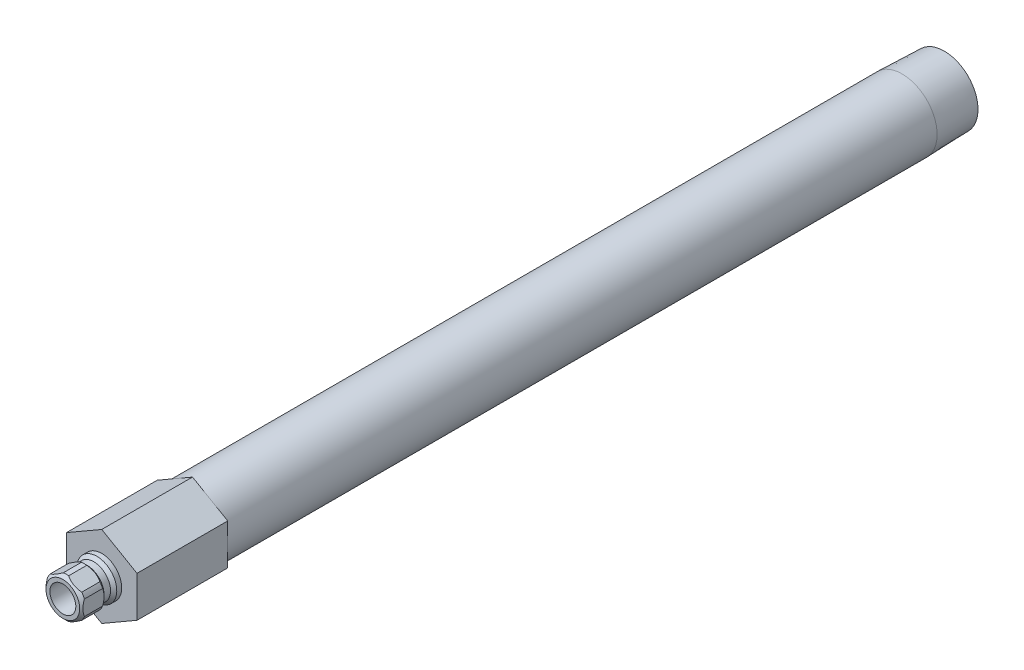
from build123d import *

# Parameters (mm, degrees)
SKETCH2_R           = 3.175
BOSS_EXTRUDE1_DEPTH = 22.225
CUT_EXTRUDE1_START  = 3.556
SKETCH3_OUTSIDE_W   = 62.774
SKETCH3_OUTSIDE_H   = 65.446
CUT_EXTRUDE1_DEPTH  = 204.240184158


with BuildPart() as part:
    # Sketch1 → Revolve1 (revolve)
    with BuildSketch(Plane(origin=(0, 0, 0), x_dir=(0, 0, -1), z_dir=(1, 0, 0))):
        Polygon((-9.525, 3.175), (-9.525, 4.1275), (-8.763, 4.8895), (-4.318, 4.8895), (-3.556, 4.1275), (-1.9685, 4.1275), (-1.2065, 4.8895), (0, 4.8895), (0, 8.5725), (196.0372, 8.5725), (206.375, 8.249445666), (206.375, 6.2611), (22.225, 6.2611), (22.225, 3.175), align=None)
    revolve(axis=Axis((0, 0, 0), (0, 0, 1)))

    # Sketch2 → Boss-Extrude1 (add)
    with BuildSketch(Plane.XY):
        Polygon((-8.636, 4.985996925), (-8.636, -4.985996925), (0, -9.971993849), (8.636, -4.985996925), (8.636, 4.985996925), (0, 9.971993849), align=None)
        with Locations(Location((0, 0, 0), (0, 0, 90))):
            Circle(SKETCH2_R, mode=Mode.SUBTRACT)
    extrude(amount=-BOSS_EXTRUDE1_DEPTH)

    # Sketch3 outside → Cut-Extrude1 (cut, through all)
    with BuildSketch(Plane.XY.offset(CUT_EXTRUDE1_START)):
        Rectangle(SKETCH3_OUTSIDE_W, SKETCH3_OUTSIDE_H)
        Polygon((4.5212, 2.610316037), (0, 5.220632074), (-4.5212, 2.610316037), (-4.5212, -2.610316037), (0, -5.220632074), (4.5212, -2.610316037), align=None, mode=Mode.SUBTRACT)
    extrude(amount=CUT_EXTRUDE1_DEPTH, mode=Mode.SUBTRACT)


solid = part.part
